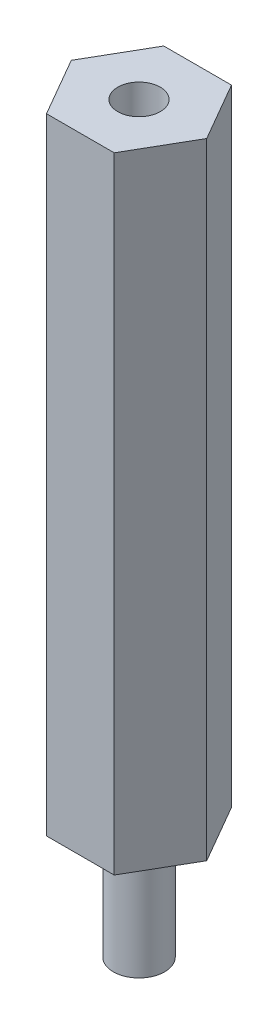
ISO-10303-21;
HEADER;
FILE_DESCRIPTION(('STEP AP214'),'2;1');
FILE_NAME('part.step','',(''),(''),'','','');
FILE_SCHEMA(('AUTOMOTIVE_DESIGN { 1 0 10303 214 1 1 1 1 }'));
ENDSEC;
DATA;
#1=APPLICATION_CONTEXT('core data for automotive mechanical design processes');
#2=APPLICATION_PROTOCOL_DEFINITION('international standard','automotive_design',2000,#1);
#3=PRODUCT_CONTEXT('',#1,'mechanical');
#4=PRODUCT('Part','Part','',(#3));
#5=PRODUCT_RELATED_PRODUCT_CATEGORY('part','',(#4));
#6=PRODUCT_DEFINITION_FORMATION('','',#4);
#7=PRODUCT_DEFINITION_CONTEXT('part definition',#1,'design');
#8=PRODUCT_DEFINITION('design','',#6,#7);
#9=PRODUCT_DEFINITION_SHAPE('','',#8);
#10=(LENGTH_UNIT() NAMED_UNIT(*) SI_UNIT(.MILLI.,.METRE.));
#11=(NAMED_UNIT(*) PLANE_ANGLE_UNIT() SI_UNIT($,.RADIAN.));
#12=(NAMED_UNIT(*) SI_UNIT($,.STERADIAN.) SOLID_ANGLE_UNIT());
#13=UNCERTAINTY_MEASURE_WITH_UNIT(LENGTH_MEASURE(1.E-05),#10,'distance_accuracy_value','');
#14=(GEOMETRIC_REPRESENTATION_CONTEXT(3) GLOBAL_UNCERTAINTY_ASSIGNED_CONTEXT((#13)) GLOBAL_UNIT_ASSIGNED_CONTEXT((#10,
#11,#12)) REPRESENTATION_CONTEXT('',''));
#15=CARTESIAN_POINT('',(0.,0.,0.));
#16=DIRECTION('',(0.,0.,1.));
#17=DIRECTION('',(1.,0.,0.));
#18=AXIS2_PLACEMENT_3D('',#15,#16,#17);
#19=CARTESIAN_POINT('',(8.24889197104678,0.,-4.7625));
#20=DIRECTION('',(0.,1.,0.));
#21=DIRECTION('',(0.,0.,1.));
#22=AXIS2_PLACEMENT_3D('',#19,#20,#21);
#23=PLANE('',#22);
#24=DIRECTION('',(0.5,0.,-0.866025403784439));
#25=VECTOR('',#24,1.);
#26=CARTESIAN_POINT('',(2.74963065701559,0.,4.7625));
#27=LINE('',#26,#25);
#28=CARTESIAN_POINT('',(2.74963065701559,0.,4.7625));
#29=VERTEX_POINT('',#28);
#30=CARTESIAN_POINT('',(5.49926131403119,0.,0.));
#31=VERTEX_POINT('',#30);
#32=EDGE_CURVE('E109',#29,#31,#27,.T.);
#33=ORIENTED_EDGE('',*,*,#32,.F.);
#34=DIRECTION('',(1.,0.,0.));
#35=VECTOR('',#34,1.);
#36=CARTESIAN_POINT('',(-2.74963065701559,0.,4.7625));
#37=LINE('',#36,#35);
#38=CARTESIAN_POINT('',(-2.74963065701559,0.,4.7625));
#39=VERTEX_POINT('',#38);
#40=EDGE_CURVE('E120',#39,#29,#37,.T.);
#41=ORIENTED_EDGE('',*,*,#40,.F.);
#42=DIRECTION('',(0.5,0.,0.866025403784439));
#43=VECTOR('',#42,1.);
#44=CARTESIAN_POINT('',(-5.49926131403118,0.,0.));
#45=LINE('',#44,#43);
#46=CARTESIAN_POINT('',(-5.49926131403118,0.,0.));
#47=VERTEX_POINT('',#46);
#48=EDGE_CURVE('E118',#47,#39,#45,.T.);
#49=ORIENTED_EDGE('',*,*,#48,.F.);
#50=DIRECTION('',(-0.5,0.,0.866025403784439));
#51=VECTOR('',#50,1.);
#52=CARTESIAN_POINT('',(-2.74963065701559,0.,-4.7625));
#53=LINE('',#52,#51);
#54=CARTESIAN_POINT('',(-2.74963065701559,0.,-4.7625));
#55=VERTEX_POINT('',#54);
#56=EDGE_CURVE('E116',#55,#47,#53,.T.);
#57=ORIENTED_EDGE('',*,*,#56,.F.);
#58=DIRECTION('',(-1.,0.,0.));
#59=VECTOR('',#58,1.);
#60=CARTESIAN_POINT('',(2.74963065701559,0.,-4.7625));
#61=LINE('',#60,#59);
#62=CARTESIAN_POINT('',(2.74963065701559,0.,-4.7625));
#63=VERTEX_POINT('',#62);
#64=EDGE_CURVE('E114',#63,#55,#61,.T.);
#65=ORIENTED_EDGE('',*,*,#64,.F.);
#66=DIRECTION('',(-0.5,0.,-0.866025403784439));
#67=VECTOR('',#66,1.);
#68=CARTESIAN_POINT('',(5.49926131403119,0.,0.));
#69=LINE('',#68,#67);
#70=EDGE_CURVE('E112',#31,#63,#69,.T.);
#71=ORIENTED_EDGE('',*,*,#70,.F.);
#72=EDGE_LOOP('',(#33,#41,#49,#57,#65,#71));
#73=FACE_BOUND('',#72,.T.);
#74=CARTESIAN_POINT('',(0.,0.,0.));
#75=DIRECTION('',(0.,1.,0.));
#76=DIRECTION('',(0.,0.,1.));
#77=AXIS2_PLACEMENT_3D('',#74,#75,#76);
#78=CIRCLE('',#77,2.0828);
#79=CARTESIAN_POINT('',(0.,0.,2.0828));
#80=VERTEX_POINT('',#79);
#81=EDGE_CURVE('E11',#80,#80,#78,.F.);
#82=ORIENTED_EDGE('',*,*,#81,.F.);
#83=EDGE_LOOP('',(#82));
#84=FACE_BOUND('',#83,.T.);
#85=ADVANCED_FACE('F38',(#73,#84),#23,.F.);
#86=CARTESIAN_POINT('',(2.74963065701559,50.8,4.7625));
#87=DIRECTION('',(-0.866025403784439,0.,-0.5));
#88=DIRECTION('',(-0.5,0.,0.866025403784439));
#89=AXIS2_PLACEMENT_3D('',#86,#87,#88);
#90=PLANE('',#89);
#91=ORIENTED_EDGE('',*,*,#32,.T.);
#92=DIRECTION('',(0.,-1.,0.));
#93=VECTOR('',#92,1.);
#94=CARTESIAN_POINT('',(5.49926131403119,50.8,0.));
#95=LINE('',#94,#93);
#96=CARTESIAN_POINT('',(5.49926131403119,50.8,0.));
#97=VERTEX_POINT('',#96);
#98=EDGE_CURVE('E46',#97,#31,#95,.T.);
#99=ORIENTED_EDGE('',*,*,#98,.F.);
#100=DIRECTION('',(0.5,0.,-0.866025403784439));
#101=VECTOR('',#100,1.);
#102=CARTESIAN_POINT('',(2.74963065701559,50.8,4.7625));
#103=LINE('',#102,#101);
#104=CARTESIAN_POINT('',(2.74963065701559,50.8,4.7625));
#105=VERTEX_POINT('',#104);
#106=EDGE_CURVE('E122',#105,#97,#103,.T.);
#107=ORIENTED_EDGE('',*,*,#106,.F.);
#108=DIRECTION('',(0.,-1.,0.));
#109=VECTOR('',#108,1.);
#110=CARTESIAN_POINT('',(2.74963065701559,50.8,4.7625));
#111=LINE('',#110,#109);
#112=EDGE_CURVE('E132',#105,#29,#111,.T.);
#113=ORIENTED_EDGE('',*,*,#112,.T.);
#114=EDGE_LOOP('',(#91,#99,#107,#113));
#115=FACE_BOUND('',#114,.T.);
#116=ADVANCED_FACE('F40',(#115),#90,.F.);
#117=CARTESIAN_POINT('',(5.49926131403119,50.8,0.));
#118=DIRECTION('',(-0.866025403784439,0.,0.5));
#119=DIRECTION('',(0.5,0.,0.866025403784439));
#120=AXIS2_PLACEMENT_3D('',#117,#118,#119);
#121=PLANE('',#120);
#122=ORIENTED_EDGE('',*,*,#70,.T.);
#123=DIRECTION('',(0.,-1.,0.));
#124=VECTOR('',#123,1.);
#125=CARTESIAN_POINT('',(2.74963065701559,50.8,-4.7625));
#126=LINE('',#125,#124);
#127=CARTESIAN_POINT('',(2.74963065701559,50.8,-4.7625));
#128=VERTEX_POINT('',#127);
#129=EDGE_CURVE('E144',#128,#63,#126,.T.);
#130=ORIENTED_EDGE('',*,*,#129,.F.);
#131=DIRECTION('',(-0.5,0.,-0.866025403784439));
#132=VECTOR('',#131,1.);
#133=CARTESIAN_POINT('',(5.49926131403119,50.8,0.));
#134=LINE('',#133,#132);
#135=EDGE_CURVE('E124',#97,#128,#134,.T.);
#136=ORIENTED_EDGE('',*,*,#135,.F.);
#137=ORIENTED_EDGE('',*,*,#98,.T.);
#138=EDGE_LOOP('',(#122,#130,#136,#137));
#139=FACE_BOUND('',#138,.T.);
#140=ADVANCED_FACE('F149',(#139),#121,.F.);
#141=CARTESIAN_POINT('',(2.74963065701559,50.8,-4.7625));
#142=DIRECTION('',(0.,0.,1.));
#143=DIRECTION('',(1.,0.,0.));
#144=AXIS2_PLACEMENT_3D('',#141,#142,#143);
#145=PLANE('',#144);
#146=ORIENTED_EDGE('',*,*,#64,.T.);
#147=DIRECTION('',(0.,-1.,0.));
#148=VECTOR('',#147,1.);
#149=CARTESIAN_POINT('',(-2.74963065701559,50.8,-4.7625));
#150=LINE('',#149,#148);
#151=CARTESIAN_POINT('',(-2.74963065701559,50.8,-4.7625));
#152=VERTEX_POINT('',#151);
#153=EDGE_CURVE('E141',#152,#55,#150,.T.);
#154=ORIENTED_EDGE('',*,*,#153,.F.);
#155=DIRECTION('',(-1.,0.,0.));
#156=VECTOR('',#155,1.);
#157=CARTESIAN_POINT('',(2.74963065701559,50.8,-4.7625));
#158=LINE('',#157,#156);
#159=EDGE_CURVE('E126',#128,#152,#158,.T.);
#160=ORIENTED_EDGE('',*,*,#159,.F.);
#161=ORIENTED_EDGE('',*,*,#129,.T.);
#162=EDGE_LOOP('',(#146,#154,#160,#161));
#163=FACE_BOUND('',#162,.T.);
#164=ADVANCED_FACE('F162',(#163),#145,.F.);
#165=CARTESIAN_POINT('',(-2.74963065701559,50.8,-4.7625));
#166=DIRECTION('',(0.866025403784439,0.,0.5));
#167=DIRECTION('',(0.5,0.,-0.866025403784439));
#168=AXIS2_PLACEMENT_3D('',#165,#166,#167);
#169=PLANE('',#168);
#170=ORIENTED_EDGE('',*,*,#56,.T.);
#171=DIRECTION('',(0.,-1.,0.));
#172=VECTOR('',#171,1.);
#173=CARTESIAN_POINT('',(-5.49926131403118,50.8,0.));
#174=LINE('',#173,#172);
#175=CARTESIAN_POINT('',(-5.49926131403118,50.8,0.));
#176=VERTEX_POINT('',#175);
#177=EDGE_CURVE('E138',#176,#47,#174,.T.);
#178=ORIENTED_EDGE('',*,*,#177,.F.);
#179=DIRECTION('',(-0.5,0.,0.866025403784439));
#180=VECTOR('',#179,1.);
#181=CARTESIAN_POINT('',(-2.74963065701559,50.8,-4.7625));
#182=LINE('',#181,#180);
#183=EDGE_CURVE('E128',#152,#176,#182,.T.);
#184=ORIENTED_EDGE('',*,*,#183,.F.);
#185=ORIENTED_EDGE('',*,*,#153,.T.);
#186=EDGE_LOOP('',(#170,#178,#184,#185));
#187=FACE_BOUND('',#186,.T.);
#188=ADVANCED_FACE('F166',(#187),#169,.F.);
#189=CARTESIAN_POINT('',(-5.49926131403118,50.8,0.));
#190=DIRECTION('',(0.866025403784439,0.,-0.5));
#191=DIRECTION('',(-0.5,0.,-0.866025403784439));
#192=AXIS2_PLACEMENT_3D('',#189,#190,#191);
#193=PLANE('',#192);
#194=ORIENTED_EDGE('',*,*,#48,.T.);
#195=DIRECTION('',(0.,-1.,0.));
#196=VECTOR('',#195,1.);
#197=CARTESIAN_POINT('',(-2.74963065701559,50.8,4.7625));
#198=LINE('',#197,#196);
#199=CARTESIAN_POINT('',(-2.74963065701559,50.8,4.7625));
#200=VERTEX_POINT('',#199);
#201=EDGE_CURVE('E135',#200,#39,#198,.T.);
#202=ORIENTED_EDGE('',*,*,#201,.F.);
#203=DIRECTION('',(0.5,0.,0.866025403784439));
#204=VECTOR('',#203,1.);
#205=CARTESIAN_POINT('',(-5.49926131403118,50.8,0.));
#206=LINE('',#205,#204);
#207=EDGE_CURVE('E58',#176,#200,#206,.T.);
#208=ORIENTED_EDGE('',*,*,#207,.F.);
#209=ORIENTED_EDGE('',*,*,#177,.T.);
#210=EDGE_LOOP('',(#194,#202,#208,#209));
#211=FACE_BOUND('',#210,.T.);
#212=ADVANCED_FACE('F181',(#211),#193,.F.);
#213=CARTESIAN_POINT('',(-2.74963065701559,50.8,4.7625));
#214=DIRECTION('',(0.,0.,-1.));
#215=DIRECTION('',(-1.,0.,0.));
#216=AXIS2_PLACEMENT_3D('',#213,#214,#215);
#217=PLANE('',#216);
#218=ORIENTED_EDGE('',*,*,#40,.T.);
#219=ORIENTED_EDGE('',*,*,#112,.F.);
#220=DIRECTION('',(1.,0.,0.));
#221=VECTOR('',#220,1.);
#222=CARTESIAN_POINT('',(-2.74963065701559,50.8,4.7625));
#223=LINE('',#222,#221);
#224=EDGE_CURVE('E53',#200,#105,#223,.T.);
#225=ORIENTED_EDGE('',*,*,#224,.F.);
#226=ORIENTED_EDGE('',*,*,#201,.T.);
#227=EDGE_LOOP('',(#218,#219,#225,#226));
#228=FACE_BOUND('',#227,.T.);
#229=ADVANCED_FACE('F171',(#228),#217,.F.);
#230=CARTESIAN_POINT('',(8.24889197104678,50.8,-4.7625));
#231=DIRECTION('',(0.,1.,0.));
#232=DIRECTION('',(0.,0.,1.));
#233=AXIS2_PLACEMENT_3D('',#230,#231,#232);
#234=PLANE('',#233);
#235=CARTESIAN_POINT('',(0.,50.8,0.));
#236=DIRECTION('',(0.,1.,0.));
#237=DIRECTION('',(0.,0.,1.));
#238=AXIS2_PLACEMENT_3D('',#235,#236,#237);
#239=CIRCLE('',#238,1.7272);
#240=CARTESIAN_POINT('',(0.,50.8,1.7272));
#241=VERTEX_POINT('',#240);
#242=EDGE_CURVE('E101',#241,#241,#239,.T.);
#243=ORIENTED_EDGE('',*,*,#242,.F.);
#244=EDGE_LOOP('',(#243));
#245=FACE_BOUND('',#244,.T.);
#246=ORIENTED_EDGE('',*,*,#106,.T.);
#247=ORIENTED_EDGE('',*,*,#135,.T.);
#248=ORIENTED_EDGE('',*,*,#159,.T.);
#249=ORIENTED_EDGE('',*,*,#183,.T.);
#250=ORIENTED_EDGE('',*,*,#207,.T.);
#251=ORIENTED_EDGE('',*,*,#224,.T.);
#252=EDGE_LOOP('',(#246,#247,#248,#249,#250,#251));
#253=FACE_BOUND('',#252,.T.);
#254=ADVANCED_FACE('F168',(#245,#253),#234,.T.);
#255=CARTESIAN_POINT('',(0.,-9.525,0.));
#256=DIRECTION('',(0.,1.,0.));
#257=DIRECTION('',(0.,0.,1.));
#258=AXIS2_PLACEMENT_3D('',#255,#256,#257);
#259=CYLINDRICAL_SURFACE('',#258,2.0828);
#260=CARTESIAN_POINT('',(0.,-9.525,0.));
#261=DIRECTION('',(0.,-1.,0.));
#262=DIRECTION('',(0.,0.,-1.));
#263=AXIS2_PLACEMENT_3D('',#260,#261,#262);
#264=CIRCLE('',#263,2.0828);
#265=CARTESIAN_POINT('',(0.,-9.525,2.0828));
#266=VERTEX_POINT('',#265);
#267=EDGE_CURVE('E104',#266,#266,#264,.T.);
#268=CARTESIAN_POINT('',(0.,-9.525,2.0828));
#269=CARTESIAN_POINT('',(0.,-9.42578125,2.0828));
#270=CARTESIAN_POINT('',(0.,-9.3265625,2.0828));
#271=CARTESIAN_POINT('',(0.,-9.128125,2.0828));
#272=CARTESIAN_POINT('',(0.,-9.02890625,2.0828));
#273=CARTESIAN_POINT('',(0.,-8.83046875,2.0828));
#274=CARTESIAN_POINT('',(0.,-8.73125,2.0828));
#275=CARTESIAN_POINT('',(0.,-8.5328125,2.0828));
#276=CARTESIAN_POINT('',(0.,-8.43359375,2.0828));
#277=CARTESIAN_POINT('',(0.,-8.23515625,2.0828));
#278=CARTESIAN_POINT('',(0.,-8.1359375,2.0828));
#279=CARTESIAN_POINT('',(0.,-7.9375,2.0828));
#280=CARTESIAN_POINT('',(0.,-7.83828125,2.0828));
#281=CARTESIAN_POINT('',(0.,-7.63984375,2.0828));
#282=CARTESIAN_POINT('',(0.,-7.540625,2.0828));
#283=CARTESIAN_POINT('',(0.,-7.3421875,2.0828));
#284=CARTESIAN_POINT('',(0.,-7.24296875,2.0828));
#285=CARTESIAN_POINT('',(0.,-7.04453125,2.0828));
#286=CARTESIAN_POINT('',(0.,-6.9453125,2.0828));
#287=CARTESIAN_POINT('',(0.,-6.746875,2.0828));
#288=CARTESIAN_POINT('',(0.,-6.64765625,2.0828));
#289=CARTESIAN_POINT('',(0.,-6.44921875,2.0828));
#290=CARTESIAN_POINT('',(0.,-6.35,2.0828));
#291=CARTESIAN_POINT('',(0.,-6.1515625,2.0828));
#292=CARTESIAN_POINT('',(0.,-6.05234375,2.0828));
#293=CARTESIAN_POINT('',(0.,-5.85390625,2.0828));
#294=CARTESIAN_POINT('',(0.,-5.7546875,2.0828));
#295=CARTESIAN_POINT('',(0.,-5.55625,2.0828));
#296=CARTESIAN_POINT('',(0.,-5.45703125,2.0828));
#297=CARTESIAN_POINT('',(0.,-5.25859375,2.0828));
#298=CARTESIAN_POINT('',(0.,-5.159375,2.0828));
#299=CARTESIAN_POINT('',(0.,-4.9609375,2.0828));
#300=CARTESIAN_POINT('',(0.,-4.86171875,2.0828));
#301=CARTESIAN_POINT('',(0.,-4.66328125,2.0828));
#302=CARTESIAN_POINT('',(0.,-4.5640625,2.0828));
#303=CARTESIAN_POINT('',(0.,-4.365625,2.0828));
#304=CARTESIAN_POINT('',(0.,-4.26640625,2.0828));
#305=CARTESIAN_POINT('',(0.,-4.06796875,2.0828));
#306=CARTESIAN_POINT('',(0.,-3.96875,2.0828));
#307=CARTESIAN_POINT('',(0.,-3.7703125,2.0828));
#308=CARTESIAN_POINT('',(0.,-3.67109375,2.0828));
#309=CARTESIAN_POINT('',(0.,-3.47265625,2.0828));
#310=CARTESIAN_POINT('',(0.,-3.3734375,2.0828));
#311=CARTESIAN_POINT('',(0.,-3.175,2.0828));
#312=CARTESIAN_POINT('',(0.,-3.07578125,2.0828));
#313=CARTESIAN_POINT('',(0.,-2.87734375,2.0828));
#314=CARTESIAN_POINT('',(0.,-2.778125,2.0828));
#315=CARTESIAN_POINT('',(0.,-2.5796875,2.0828));
#316=CARTESIAN_POINT('',(0.,-2.48046875,2.0828));
#317=CARTESIAN_POINT('',(0.,-2.28203125,2.0828));
#318=CARTESIAN_POINT('',(0.,-2.1828125,2.0828));
#319=CARTESIAN_POINT('',(0.,-1.984375,2.0828));
#320=CARTESIAN_POINT('',(0.,-1.88515625,2.0828));
#321=CARTESIAN_POINT('',(0.,-1.68671875,2.0828));
#322=CARTESIAN_POINT('',(0.,-1.5875,2.0828));
#323=CARTESIAN_POINT('',(0.,-1.3890625,2.0828));
#324=CARTESIAN_POINT('',(0.,-1.28984375,2.0828));
#325=CARTESIAN_POINT('',(0.,-1.09140625,2.0828));
#326=CARTESIAN_POINT('',(0.,-0.992187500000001,2.0828));
#327=CARTESIAN_POINT('',(0.,-0.793750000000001,2.0828));
#328=CARTESIAN_POINT('',(0.,-0.69453125,2.0828));
#329=CARTESIAN_POINT('',(0.,-0.49609375,2.0828));
#330=CARTESIAN_POINT('',(0.,-0.396875,2.0828));
#331=CARTESIAN_POINT('',(0.,-0.1984375,2.0828));
#332=CARTESIAN_POINT('',(0.,-0.0992187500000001,2.0828));
#333=CARTESIAN_POINT('',(0.,0.,2.0828));
#334=B_SPLINE_CURVE_WITH_KNOTS('',3,(#268,#269,#270,#271,#272,#273,#274,#275,#276,#277,#278,
#279,#280,#281,#282,#283,#284,#285,#286,#287,#288,#289,#290,#291,#292,#293,#294,#295,#296,#297,
#298,#299,#300,#301,#302,#303,#304,#305,#306,#307,#308,#309,#310,#311,#312,#313,#314,#315,#316,
#317,#318,#319,#320,#321,#322,#323,#324,#325,#326,#327,#328,#329,#330,#331,#332,#333),
.UNSPECIFIED.,.F.,.F.,(4,2,2,2,2,2,2,2,2,2,2,2,2,2,2,2,2,2,2,2,2,2,2,2,2,2,2,2,2,2,2,2,4),(0.,
0.297656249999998,0.595312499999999,0.892968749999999,1.190625,1.48828125,1.7859375,2.08359375,
2.38125,2.67890625,2.9765625,3.27421875,3.571875,3.86953125,4.1671875,4.46484375,4.7625,
5.06015625,5.3578125,5.65546875,5.953125,6.25078125,6.5484375,6.84609375,7.14375,7.44140625,
7.7390625,8.03671875,8.334375,8.63203125,8.9296875,9.22734375,9.525),.UNSPECIFIED.);
#335=EDGE_CURVE('BSEAM170',#266,#80,#334,.T.);
#336=ORIENTED_EDGE('',*,*,#267,.F.);
#337=ORIENTED_EDGE('',*,*,#81,.T.);
#338=ORIENTED_EDGE('',*,*,#335,.T.);
#339=ORIENTED_EDGE('',*,*,#335,.F.);
#340=EDGE_LOOP('',(#336,#338,#337,#339));
#341=FACE_BOUND('',#340,.T.);
#342=ADVANCED_FACE('F170',(#341),#259,.T.);
#343=CARTESIAN_POINT('',(0.,-9.525,0.));
#344=DIRECTION('',(0.,-1.,0.));
#345=DIRECTION('',(0.,0.,-1.));
#346=AXIS2_PLACEMENT_3D('',#343,#344,#345);
#347=PLANE('',#346);
#348=ORIENTED_EDGE('',*,*,#267,.T.);
#349=EDGE_LOOP('',(#348));
#350=FACE_BOUND('',#349,.T.);
#351=ADVANCED_FACE('F178',(#350),#347,.T.);
#352=CARTESIAN_POINT('',(0.,50.8,0.));
#353=DIRECTION('',(0.,1.,0.));
#354=DIRECTION('',(0.,0.,1.));
#355=AXIS2_PLACEMENT_3D('',#352,#353,#354);
#356=CYLINDRICAL_SURFACE('',#355,1.7272);
#357=CARTESIAN_POINT('',(0.,36.9316,0.));
#358=DIRECTION('',(0.,1.,0.));
#359=DIRECTION('',(0.,0.,1.));
#360=AXIS2_PLACEMENT_3D('',#357,#358,#359);
#361=CIRCLE('',#360,1.7272);
#362=CARTESIAN_POINT('',(0.,36.9316,1.7272));
#363=VERTEX_POINT('',#362);
#364=EDGE_CURVE('E99',#363,#363,#361,.T.);
#365=ORIENTED_EDGE('',*,*,#364,.F.);
#366=EDGE_LOOP('',(#365));
#367=FACE_BOUND('',#366,.T.);
#368=ORIENTED_EDGE('',*,*,#242,.T.);
#369=EDGE_LOOP('',(#368));
#370=FACE_BOUND('',#369,.T.);
#371=ADVANCED_FACE('F95',(#367,#370),#356,.F.);
#372=CARTESIAN_POINT('',(0.,36.9316,0.));
#373=DIRECTION('',(0.,1.,0.));
#374=DIRECTION('',(0.,0.,1.));
#375=AXIS2_PLACEMENT_3D('',#372,#373,#374);
#376=CONICAL_SURFACE('',#375,1.7272,1.02974425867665);
#377=CARTESIAN_POINT('',(0.,35.8937935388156,0.));
#378=VERTEX_POINT('',#377);
#379=VERTEX_LOOP('',#378);
#380=FACE_BOUND('',#379,.T.);
#381=ORIENTED_EDGE('',*,*,#364,.T.);
#382=EDGE_LOOP('',(#381));
#383=FACE_BOUND('',#382,.T.);
#384=ADVANCED_FACE('F92',(#380,#383),#376,.F.);
#385=CLOSED_SHELL('',(#85,#116,#140,#164,#188,#212,#229,#254,#342,#351,#371,#384));
#386=MANIFOLD_SOLID_BREP('B2',#385);
#387=ADVANCED_BREP_SHAPE_REPRESENTATION('',(#18,#386),#14);
#388=SHAPE_DEFINITION_REPRESENTATION(#9,#387);
ENDSEC;
END-ISO-10303-21;
